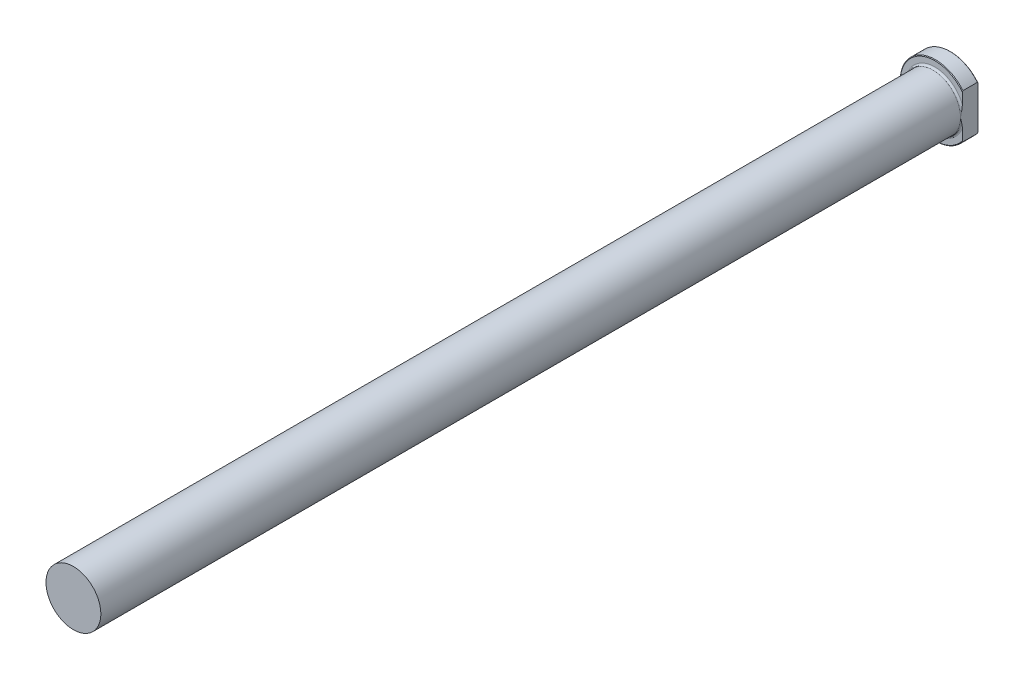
ISO-10303-21;
HEADER;
FILE_DESCRIPTION(('STEP AP214'),'2;1');
FILE_NAME('part.step','',(''),(''),'','','');
FILE_SCHEMA(('AUTOMOTIVE_DESIGN { 1 0 10303 214 1 1 1 1 }'));
ENDSEC;
DATA;
#1=APPLICATION_CONTEXT('core data for automotive mechanical design processes');
#2=APPLICATION_PROTOCOL_DEFINITION('international standard','automotive_design',2000,#1);
#3=PRODUCT_CONTEXT('',#1,'mechanical');
#4=PRODUCT('Part','Part','',(#3));
#5=PRODUCT_RELATED_PRODUCT_CATEGORY('part','',(#4));
#6=PRODUCT_DEFINITION_FORMATION('','',#4);
#7=PRODUCT_DEFINITION_CONTEXT('part definition',#1,'design');
#8=PRODUCT_DEFINITION('design','',#6,#7);
#9=PRODUCT_DEFINITION_SHAPE('','',#8);
#10=(LENGTH_UNIT() NAMED_UNIT(*) SI_UNIT(.MILLI.,.METRE.));
#11=(NAMED_UNIT(*) PLANE_ANGLE_UNIT() SI_UNIT($,.RADIAN.));
#12=(NAMED_UNIT(*) SI_UNIT($,.STERADIAN.) SOLID_ANGLE_UNIT());
#13=UNCERTAINTY_MEASURE_WITH_UNIT(LENGTH_MEASURE(1.E-05),#10,'distance_accuracy_value','');
#14=(GEOMETRIC_REPRESENTATION_CONTEXT(3) GLOBAL_UNCERTAINTY_ASSIGNED_CONTEXT((#13)) GLOBAL_UNIT_ASSIGNED_CONTEXT((#10,
#11,#12)) REPRESENTATION_CONTEXT('',''));
#15=CARTESIAN_POINT('',(0.,0.,0.));
#16=DIRECTION('',(0.,0.,1.));
#17=DIRECTION('',(1.,0.,0.));
#18=AXIS2_PLACEMENT_3D('',#15,#16,#17);
#19=CARTESIAN_POINT('',(0.,0.,0.));
#20=DIRECTION('',(0.,0.,1.));
#21=DIRECTION('',(1.,0.,0.));
#22=AXIS2_PLACEMENT_3D('',#19,#20,#21);
#23=PLANE('',#22);
#24=DIRECTION('',(0.,-1.,0.));
#25=VECTOR('',#24,1.);
#26=CARTESIAN_POINT('',(11.1125,8.98025612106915,0.));
#27=LINE('',#26,#25);
#28=CARTESIAN_POINT('',(11.1125,8.57038307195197,0.));
#29=VERTEX_POINT('',#28);
#30=CARTESIAN_POINT('',(11.1125,-8.57038307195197,0.));
#31=VERTEX_POINT('',#30);
#32=EDGE_CURVE('E196',#29,#31,#27,.T.);
#33=ORIENTED_EDGE('',*,*,#32,.T.);
#34=CARTESIAN_POINT('',(0.,0.,0.));
#35=DIRECTION('',(0.,0.,1.));
#36=DIRECTION('',(1.,0.,0.));
#37=AXIS2_PLACEMENT_3D('',#34,#35,#36);
#38=CIRCLE('',#37,14.0335);
#39=EDGE_CURVE('E11',#31,#29,#38,.F.);
#40=ORIENTED_EDGE('',*,*,#39,.T.);
#41=EDGE_LOOP('',(#33,#40));
#42=FACE_BOUND('',#41,.T.);
#43=ADVANCED_FACE('F36',(#42),#23,.F.);
#44=CARTESIAN_POINT('',(0.,0.,-2.14753999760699));
#45=DIRECTION('',(0.,0.,-1.));
#46=DIRECTION('',(-1.,0.,0.));
#47=AXIS2_PLACEMENT_3D('',#44,#45,#46);
#48=CYLINDRICAL_SURFACE('',#47,14.2875);
#49=DIRECTION('',(0.,0.,-1.));
#50=VECTOR('',#49,1.);
#51=CARTESIAN_POINT('',(11.1125,-8.98025612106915,7.62));
#52=LINE('',#51,#50);
#53=CARTESIAN_POINT('',(11.1125,-8.98025612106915,6.09600000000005));
#54=VERTEX_POINT('',#53);
#55=CARTESIAN_POINT('',(11.1125,-8.98025612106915,0.253999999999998));
#56=VERTEX_POINT('',#55);
#57=EDGE_CURVE('E194',#54,#56,#52,.T.);
#58=ORIENTED_EDGE('',*,*,#57,.F.);
#59=CARTESIAN_POINT('',(0.,0.,6.09600000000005));
#60=DIRECTION('',(0.,0.,-1.));
#61=DIRECTION('',(-1.,0.,0.));
#62=AXIS2_PLACEMENT_3D('',#59,#60,#61);
#63=CIRCLE('',#62,14.2875);
#64=CARTESIAN_POINT('',(11.1125,8.98025612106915,6.09600000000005));
#65=VERTEX_POINT('',#64);
#66=EDGE_CURVE('E113',#54,#65,#63,.T.);
#67=ORIENTED_EDGE('',*,*,#66,.T.);
#68=DIRECTION('',(0.,0.,-1.));
#69=VECTOR('',#68,1.);
#70=CARTESIAN_POINT('',(11.1125,8.98025612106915,7.62));
#71=LINE('',#70,#69);
#72=CARTESIAN_POINT('',(11.1125,8.98025612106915,0.254000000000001));
#73=VERTEX_POINT('',#72);
#74=EDGE_CURVE('E99',#65,#73,#71,.T.);
#75=ORIENTED_EDGE('',*,*,#74,.T.);
#76=CARTESIAN_POINT('',(0.,0.,0.253999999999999));
#77=DIRECTION('',(0.,0.,1.));
#78=DIRECTION('',(1.,0.,0.));
#79=AXIS2_PLACEMENT_3D('',#76,#77,#78);
#80=CIRCLE('',#79,14.2875);
#81=EDGE_CURVE('E110',#73,#56,#80,.T.);
#82=ORIENTED_EDGE('',*,*,#81,.T.);
#83=EDGE_LOOP('',(#58,#67,#75,#82));
#84=FACE_BOUND('',#83,.T.);
#85=ADVANCED_FACE('F172',(#84),#48,.T.);
#86=CARTESIAN_POINT('',(0.,-11.8745,6.35));
#87=DIRECTION('',(0.,0.,-1.));
#88=DIRECTION('',(-1.,0.,0.));
#89=AXIS2_PLACEMENT_3D('',#86,#87,#88);
#90=PLANE('',#89);
#91=DIRECTION('',(0.,-1.,0.));
#92=VECTOR('',#91,1.);
#93=CARTESIAN_POINT('',(11.1125,-11.8745,6.35));
#94=LINE('',#93,#92);
#95=CARTESIAN_POINT('',(11.1125,8.57038307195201,6.35));
#96=VERTEX_POINT('',#95);
#97=CARTESIAN_POINT('',(11.1125,4.18522329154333,6.35));
#98=VERTEX_POINT('',#97);
#99=EDGE_CURVE('E108',#96,#98,#94,.T.);
#100=ORIENTED_EDGE('',*,*,#99,.F.);
#101=CARTESIAN_POINT('',(0.,0.,6.35));
#102=DIRECTION('',(0.,0.,-1.));
#103=DIRECTION('',(-1.,0.,0.));
#104=AXIS2_PLACEMENT_3D('',#101,#102,#103);
#105=CIRCLE('',#104,14.0335000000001);
#106=CARTESIAN_POINT('',(11.1125,-8.57038307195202,6.35));
#107=VERTEX_POINT('',#106);
#108=EDGE_CURVE('E45',#96,#107,#105,.F.);
#109=ORIENTED_EDGE('',*,*,#108,.T.);
#110=CARTESIAN_POINT('',(11.1125,-4.18522329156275,6.35));
#111=VERTEX_POINT('',#110);
#112=EDGE_CURVE('E92',#111,#107,#94,.T.);
#113=ORIENTED_EDGE('',*,*,#112,.F.);
#114=CARTESIAN_POINT('',(0.,0.,6.35));
#115=DIRECTION('',(0.,0.,-1.));
#116=DIRECTION('',(-1.,0.,0.));
#117=AXIS2_PLACEMENT_3D('',#114,#115,#116);
#118=CIRCLE('',#117,11.8745);
#119=EDGE_CURVE('E105',#111,#98,#118,.T.);
#120=ORIENTED_EDGE('',*,*,#119,.T.);
#121=EDGE_LOOP('',(#100,#109,#113,#120));
#122=FACE_BOUND('',#121,.T.);
#123=ADVANCED_FACE('F104',(#122),#90,.F.);
#124=CARTESIAN_POINT('',(0.,0.,7.112));
#125=DIRECTION('',(0.,0.,-1.));
#126=DIRECTION('',(-1.,0.,0.));
#127=AXIS2_PLACEMENT_3D('',#124,#125,#126);
#128=TOROIDAL_SURFACE('',#127,11.8745,0.762000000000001);
#129=CARTESIAN_POINT('',(11.1125,0.,7.112));
#130=CARTESIAN_POINT('',(11.1125,1.67611039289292E-08,7.11200106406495));
#131=CARTESIAN_POINT('',(11.1125,4.27712926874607E-07,7.11200212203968));
#132=CARTESIAN_POINT('',(11.1125,1.5636921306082E-06,7.11200409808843));
#133=CARTESIAN_POINT('',(11.1125,2.31371109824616E-06,7.11200499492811));
#134=CARTESIAN_POINT('',(11.1125,4.10315168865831E-06,7.11200684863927));
#135=CARTESIAN_POINT('',(11.1125,5.17038916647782E-06,7.11200778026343));
#136=CARTESIAN_POINT('',(11.1125,7.38559018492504E-06,7.11200945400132));
#137=CARTESIAN_POINT('',(11.1125,8.53014646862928E-06,7.11201020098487));
#138=CARTESIAN_POINT('',(11.1125,1.29295009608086E-05,7.11201295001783));
#139=CARTESIAN_POINT('',(11.1125,1.62851482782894E-05,7.11201479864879));
#140=CARTESIAN_POINT('',(11.1125,2.29428210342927E-05,7.1120178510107));
#141=CARTESIAN_POINT('',(11.1125,2.62272887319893E-05,7.11201909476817));
#142=CARTESIAN_POINT('',(11.1125,3.99938907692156E-05,7.11202425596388));
#143=CARTESIAN_POINT('',(11.1125,5.05186713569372E-05,7.11202807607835));
#144=CARTESIAN_POINT('',(11.1125,7.04373145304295E-05,7.1120337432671));
#145=CARTESIAN_POINT('',(11.1125,7.97721476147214E-05,7.11203579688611));
#146=CARTESIAN_POINT('',(11.1125,0.000147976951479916,7.11205053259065));
#147=CARTESIAN_POINT('',(11.1125,0.000207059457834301,7.11206183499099));
#148=CARTESIAN_POINT('',(11.1125,0.00043398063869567,7.11211014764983));
#149=CARTESIAN_POINT('',(11.1125,0.000599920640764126,7.11215590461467));
#150=CARTESIAN_POINT('',(11.1125,0.0012263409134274,7.11232554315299));
#151=CARTESIAN_POINT('',(11.1125,0.00168778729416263,7.11244421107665));
#152=CARTESIAN_POINT('',(11.1125,0.0034456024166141,7.11289909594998));
#153=CARTESIAN_POINT('',(11.1125,0.00474111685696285,7.11324022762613));
#154=CARTESIAN_POINT('',(11.1125,0.0108222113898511,7.11483888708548));
#155=CARTESIAN_POINT('',(11.1125,0.0156088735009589,7.116089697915));
#156=CARTESIAN_POINT('',(11.1125,0.0903897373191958,7.13563489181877));
#157=CARTESIAN_POINT('',(11.1125,0.160375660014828,7.1539826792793));
#158=CARTESIAN_POINT('',(11.1125,0.297803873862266,7.18989721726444));
#159=CARTESIAN_POINT('',(11.1125,0.365245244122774,7.2074679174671));
#160=CARTESIAN_POINT('',(11.1125,0.507918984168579,7.24449206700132));
#161=CARTESIAN_POINT('',(11.1125,0.583155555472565,7.26392970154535));
#162=CARTESIAN_POINT('',(11.1125,0.734445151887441,7.3027330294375));
#163=CARTESIAN_POINT('',(11.1125,0.810498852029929,7.32209608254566));
#164=CARTESIAN_POINT('',(11.1125,0.989563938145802,7.36723281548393));
#165=CARTESIAN_POINT('',(11.1125,1.09261341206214,7.39285636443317));
#166=CARTESIAN_POINT('',(11.1125,1.29644189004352,7.44258460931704));
#167=CARTESIAN_POINT('',(11.1125,1.3972156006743,7.46671104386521));
#168=CARTESIAN_POINT('',(11.1125,1.73446900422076,7.54550507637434));
#169=CARTESIAN_POINT('',(11.1125,1.97153771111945,7.59769827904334));
#170=CARTESIAN_POINT('',(11.1125,2.44993274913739,7.69299233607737));
#171=CARTESIAN_POINT('',(11.1125,2.6912781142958,7.73600141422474));
#172=CARTESIAN_POINT('',(11.1125,3.06699799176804,7.79141180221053));
#173=CARTESIAN_POINT('',(11.1125,3.20062030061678,7.80887604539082));
#174=CARTESIAN_POINT('',(11.1125,3.4684556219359,7.8383555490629));
#175=CARTESIAN_POINT('',(11.1125,3.60266850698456,7.85037193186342));
#176=CARTESIAN_POINT('',(11.1125,3.87097309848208,7.86759580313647));
#177=CARTESIAN_POINT('',(11.1125,4.00506287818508,7.8728321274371));
#178=CARTESIAN_POINT('',(11.1125,4.27327734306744,7.87482540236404));
#179=CARTESIAN_POINT('',(11.1125,4.40740193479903,7.87158841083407));
#180=CARTESIAN_POINT('',(11.1125,4.61449108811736,7.85800680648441));
#181=CARTESIAN_POINT('',(11.1125,4.68770973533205,7.85153417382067));
#182=CARTESIAN_POINT('',(11.1125,4.83376141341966,7.83463637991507));
#183=CARTESIAN_POINT('',(11.1125,4.90659410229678,7.82420816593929));
#184=CARTESIAN_POINT('',(11.1125,5.0505087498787,7.79876188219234));
#185=CARTESIAN_POINT('',(11.1125,5.12160117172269,7.78380480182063));
#186=CARTESIAN_POINT('',(11.1125,5.26228423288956,7.7481971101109));
#187=CARTESIAN_POINT('',(11.1125,5.33187647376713,7.72755293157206));
#188=CARTESIAN_POINT('',(11.1125,5.46945846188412,7.67868213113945));
#189=CARTESIAN_POINT('',(11.1125,5.53741805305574,7.65036554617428));
#190=CARTESIAN_POINT('',(11.1125,5.63548783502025,7.60047171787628));
#191=CARTESIAN_POINT('',(11.1125,5.66749530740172,7.58263080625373));
#192=CARTESIAN_POINT('',(11.1125,5.72968299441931,7.54403192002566));
#193=CARTESIAN_POINT('',(11.1125,5.75986551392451,7.52327773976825));
#194=CARTESIAN_POINT('',(11.1125,5.81159971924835,7.48298973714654));
#195=CARTESIAN_POINT('',(11.1125,5.83364406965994,7.46409379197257));
#196=CARTESIAN_POINT('',(11.1125,5.87543896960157,7.423844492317));
#197=CARTESIAN_POINT('',(11.1125,5.89518772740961,7.40248924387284));
#198=CARTESIAN_POINT('',(11.1125,5.93165740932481,7.35685362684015));
#199=CARTESIAN_POINT('',(11.1125,5.94833864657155,7.33254088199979));
#200=CARTESIAN_POINT('',(11.1125,5.97700292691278,7.28128516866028));
#201=CARTESIAN_POINT('',(11.1125,5.98899940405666,7.25435000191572));
#202=CARTESIAN_POINT('',(11.1125,6.00431459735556,7.20647064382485));
#203=CARTESIAN_POINT('',(11.1125,6.00913195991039,7.18600631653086));
#204=CARTESIAN_POINT('',(11.1125,6.01523377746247,7.14455694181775));
#205=CARTESIAN_POINT('',(11.1125,6.01652073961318,7.12357227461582));
#206=CARTESIAN_POINT('',(11.1125,6.01544006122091,7.08168897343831));
#207=CARTESIAN_POINT('',(11.1125,6.01307056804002,7.06079038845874));
#208=CARTESIAN_POINT('',(11.1125,6.00489715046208,7.01967752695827));
#209=CARTESIAN_POINT('',(11.1125,5.99909062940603,6.99946378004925));
#210=CARTESIAN_POINT('',(11.1125,5.9824700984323,6.95468538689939));
#211=CARTESIAN_POINT('',(11.1125,5.97071281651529,6.93047316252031));
#212=CARTESIAN_POINT('',(11.1125,5.94345673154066,6.88426478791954));
#213=CARTESIAN_POINT('',(11.1125,5.92795063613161,6.86227307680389));
#214=CARTESIAN_POINT('',(11.1125,5.88498216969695,6.80914644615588));
#215=CARTESIAN_POINT('',(11.1125,5.85561197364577,6.77956849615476));
#216=CARTESIAN_POINT('',(11.1125,5.79282477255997,6.72511568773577));
#217=CARTESIAN_POINT('',(11.1125,5.7593977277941,6.70025290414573));
#218=CARTESIAN_POINT('',(11.1125,5.69209466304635,6.65587224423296));
#219=CARTESIAN_POINT('',(11.1125,5.65836979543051,6.63612115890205));
#220=CARTESIAN_POINT('',(11.1125,5.58935575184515,6.59954443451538));
#221=CARTESIAN_POINT('',(11.1125,5.55406519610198,6.58272144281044));
#222=CARTESIAN_POINT('',(11.1125,5.44648929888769,6.53592920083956));
#223=CARTESIAN_POINT('',(11.1125,5.37258613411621,6.50968939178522));
#224=CARTESIAN_POINT('',(11.1125,5.21497937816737,6.46235711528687));
#225=CARTESIAN_POINT('',(11.1125,5.13104738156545,6.44206732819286));
#226=CARTESIAN_POINT('',(11.1125,4.96174447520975,6.40841568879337));
#227=CARTESIAN_POINT('',(11.1125,4.87637198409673,6.39506204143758));
#228=CARTESIAN_POINT('',(11.1125,4.70479103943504,6.37390089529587));
#229=CARTESIAN_POINT('',(11.1125,4.61858122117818,6.36610493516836));
#230=CARTESIAN_POINT('',(11.1125,4.44593800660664,6.3551127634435));
#231=CARTESIAN_POINT('',(11.1125,4.35950478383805,6.35191367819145));
#232=CARTESIAN_POINT('',(11.1125,4.18313627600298,6.34931657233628));
#233=CARTESIAN_POINT('',(11.1125,4.09319902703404,6.3500755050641));
#234=CARTESIAN_POINT('',(11.1125,3.91341855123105,6.35512380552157));
#235=CARTESIAN_POINT('',(11.1125,3.82357534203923,6.35941374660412));
#236=CARTESIAN_POINT('',(11.1125,3.55421624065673,6.37680685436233));
#237=CARTESIAN_POINT('',(11.1125,3.37499035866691,6.39443360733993));
#238=CARTESIAN_POINT('',(11.1125,3.01724255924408,6.43872831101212));
#239=CARTESIAN_POINT('',(11.1125,2.83872376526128,6.46542009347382));
#240=CARTESIAN_POINT('',(11.1125,2.48281647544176,6.52563853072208));
#241=CARTESIAN_POINT('',(11.1125,2.30542826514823,6.55916684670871));
#242=CARTESIAN_POINT('',(11.1125,1.77419791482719,6.66743099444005));
#243=CARTESIAN_POINT('',(11.1125,1.42193024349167,6.74975312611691));
#244=CARTESIAN_POINT('',(11.1125,0.719954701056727,6.92356271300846));
#245=CARTESIAN_POINT('',(11.1125,0.370245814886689,7.01504629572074));
#246=CARTESIAN_POINT('',(11.1125,0.0205007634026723,7.10663167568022));
#247=CARTESIAN_POINT('',(11.1125,0.02044813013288,7.10664545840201));
#248=CARTESIAN_POINT('',(11.1125,0.0162997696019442,7.10773169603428));
#249=CARTESIAN_POINT('',(11.1125,0.0122031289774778,7.10879933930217));
#250=CARTESIAN_POINT('',(11.1125,0.00628537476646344,7.11035639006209));
#251=CARTESIAN_POINT('',(11.1125,0.00446277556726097,7.11083797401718));
#252=CARTESIAN_POINT('',(11.1125,0.00204051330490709,7.11146349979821));
#253=CARTESIAN_POINT('',(11.1125,0.00144261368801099,7.11161673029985));
#254=CARTESIAN_POINT('',(11.1125,0.000656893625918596,7.11182849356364));
#255=CARTESIAN_POINT('',(11.1125,0.000467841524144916,7.11188024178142));
#256=CARTESIAN_POINT('',(11.1125,0.000214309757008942,7.11193400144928));
#257=CARTESIAN_POINT('',(11.1125,0.000151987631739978,7.11194599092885));
#258=CARTESIAN_POINT('',(11.1125,8.04801638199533E-05,7.11196214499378));
#259=CARTESIAN_POINT('',(11.1125,7.0965084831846E-05,7.11196434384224));
#260=CARTESIAN_POINT('',(11.1125,5.06772317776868E-05,7.11197043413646));
#261=CARTESIAN_POINT('',(11.1125,3.99730822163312E-05,7.11197455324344));
#262=CARTESIAN_POINT('',(11.1125,2.60206348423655E-05,7.11198010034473));
#263=CARTESIAN_POINT('',(11.1125,2.272273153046E-05,7.11198142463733));
#264=CARTESIAN_POINT('',(11.1125,1.60514754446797E-05,7.11198465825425));
#265=CARTESIAN_POINT('',(11.1125,1.26973590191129E-05,7.11198660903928));
#266=CARTESIAN_POINT('',(11.1125,8.31551979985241E-06,7.1119894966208));
#267=CARTESIAN_POINT('',(11.1125,7.17988653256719E-06,7.11199027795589));
#268=CARTESIAN_POINT('',(11.1125,4.98873174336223E-06,7.11199202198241));
#269=CARTESIAN_POINT('',(11.1125,3.93683648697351E-06,7.11199298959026));
#270=CARTESIAN_POINT('',(11.1125,2.18345050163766E-06,7.11199490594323));
#271=CARTESIAN_POINT('',(11.1125,1.45279924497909E-06,7.11199582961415));
#272=CARTESIAN_POINT('',(11.1125,3.65698335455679E-07,7.11199785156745));
#273=CARTESIAN_POINT('',(11.1125,-1.68724016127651E-08,7.11199892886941));
#274=CARTESIAN_POINT('',(11.1125,0.,7.112));
#275=B_SPLINE_CURVE_WITH_KNOTS('',3,(#129,#130,#131,#132,#133,#134,#135,#136,#137,#138,#139,
#140,#141,#142,#143,#144,#145,#146,#147,#148,#149,#150,#151,#152,#153,#154,#155,#156,#157,#158,
#159,#160,#161,#162,#163,#164,#165,#166,#167,#168,#169,#170,#171,#172,#173,#174,#175,#176,#177,
#178,#179,#180,#181,#182,#183,#184,#185,#186,#187,#188,#189,#190,#191,#192,#193,#194,#195,#196,
#197,#198,#199,#200,#201,#202,#203,#204,#205,#206,#207,#208,#209,#210,#211,#212,#213,#214,#215,
#216,#217,#218,#219,#220,#221,#222,#223,#224,#225,#226,#227,#228,#229,#230,#231,#232,#233,#234,
#235,#236,#237,#238,#239,#240,#241,#242,#243,#244,#245,#246,#247,#248,#249,#250,#251,#252,#253,
#254,#255,#256,#257,#258,#259,#260,#261,#262,#263,#264,#265,#266,#267,#268,#269,#270,#271,#272,
#273,#274),.UNSPECIFIED.,.T.,.F.,(4,2,2,2,2,2,2,2,2,2,2,2,2,2,2,2,2,2,2,2,2,2,2,2,2,2,2,2,2,2,2,
2,2,2,2,2,2,2,2,2,2,2,2,2,2,2,2,2,2,2,2,2,2,2,2,2,2,2,2,2,2,2,2,2,2,2,2,2,2,2,2,2,4),(0.,
3.21749080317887E-06,6.72527292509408E-06,1.09505995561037E-05,1.5048438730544E-05,
2.65003533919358E-05,3.70273618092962E-05,7.05609839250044E-05,9.92021986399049E-05,
0.000279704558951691,0.000795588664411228,0.00222546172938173,0.0062439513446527,
0.0210868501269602,0.238132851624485,0.447212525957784,0.680332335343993,0.915771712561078,
1.23432999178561,1.54519220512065,2.27332049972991,3.00841570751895,3.41260707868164,
3.81671514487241,4.21909881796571,4.62119489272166,4.84162349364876,5.06222255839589,
5.27997385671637,5.49747985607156,5.71765571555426,5.82747004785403,5.9371426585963,
6.02409526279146,6.11111528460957,6.19919218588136,6.28701462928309,6.34981252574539,
6.41256581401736,6.47535090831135,6.53818349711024,6.61848147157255,6.69893691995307,
6.82328358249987,6.94794450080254,7.06501811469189,7.18219703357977,7.41685552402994,
7.67555303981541,7.93455588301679,8.19409490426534,8.4534716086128,8.72321009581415,
8.99299239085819,9.53291461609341,10.0742674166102,10.6157519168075,11.7006579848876,
12.7851073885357,12.785270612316,12.7979720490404,12.8036266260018,12.8054789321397,
12.8060663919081,12.8062568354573,12.8062860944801,12.8063204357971,12.8063310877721,
12.8063426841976,12.8063468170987,12.8063510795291,12.8063546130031,12.8063578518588),.UNSPECIFIED.);
#276=CARTESIAN_POINT('',(11.1125,0.,7.112));
#277=VERTEX_POINT('',#276);
#278=EDGE_CURVE('E95',#98,#277,#275,.T.);
#279=ORIENTED_EDGE('',*,*,#278,.F.);
#280=ORIENTED_EDGE('',*,*,#119,.F.);
#281=CARTESIAN_POINT('',(11.1125,0.,7.112));
#282=CARTESIAN_POINT('',(11.1125,-1.67611039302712E-08,7.11199893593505));
#283=CARTESIAN_POINT('',(11.1125,-4.27712926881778E-07,7.11199787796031));
#284=CARTESIAN_POINT('',(11.1125,-1.56369213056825E-06,7.11199590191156));
#285=CARTESIAN_POINT('',(11.1125,-2.31371109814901E-06,7.11199500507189));
#286=CARTESIAN_POINT('',(11.1125,-4.10315168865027E-06,7.11199315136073));
#287=CARTESIAN_POINT('',(11.1125,-5.17038916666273E-06,7.11199221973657));
#288=CARTESIAN_POINT('',(11.1125,-7.38559018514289E-06,7.11199054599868));
#289=CARTESIAN_POINT('',(11.1125,-8.53014646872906E-06,7.11198979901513));
#290=CARTESIAN_POINT('',(11.1125,-1.29295009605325E-05,7.11198704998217));
#291=CARTESIAN_POINT('',(11.1125,-1.62851482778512E-05,7.1119852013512));
#292=CARTESIAN_POINT('',(11.1125,-2.29428210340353E-05,7.1119821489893));
#293=CARTESIAN_POINT('',(11.1125,-2.6227288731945E-05,7.11198090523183));
#294=CARTESIAN_POINT('',(11.1125,-3.99938907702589E-05,7.11197574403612));
#295=CARTESIAN_POINT('',(11.1125,-5.05186713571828E-05,7.11197192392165));
#296=CARTESIAN_POINT('',(11.1125,-7.04373145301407E-05,7.1119662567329));
#297=CARTESIAN_POINT('',(11.1125,-7.97721476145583E-05,7.11196420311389));
#298=CARTESIAN_POINT('',(11.1125,-0.000147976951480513,7.11194946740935));
#299=CARTESIAN_POINT('',(11.1125,-0.000207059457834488,7.11193816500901));
#300=CARTESIAN_POINT('',(11.1125,-0.000433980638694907,7.11188985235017));
#301=CARTESIAN_POINT('',(11.1125,-0.000599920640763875,7.11184409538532));
#302=CARTESIAN_POINT('',(11.1125,-0.00122634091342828,7.11167445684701));
#303=CARTESIAN_POINT('',(11.1125,-0.00168778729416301,7.11155578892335));
#304=CARTESIAN_POINT('',(11.1125,-0.00344560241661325,7.11110090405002));
#305=CARTESIAN_POINT('',(11.1125,-0.0047411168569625,7.11075977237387));
#306=CARTESIAN_POINT('',(11.1125,-0.0108222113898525,7.10916111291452));
#307=CARTESIAN_POINT('',(11.1125,-0.0156088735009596,7.107910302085));
#308=CARTESIAN_POINT('',(11.1125,-0.0903897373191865,7.08836510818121));
#309=CARTESIAN_POINT('',(11.1125,-0.160375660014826,7.07001732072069));
#310=CARTESIAN_POINT('',(11.1125,-0.297803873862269,7.03410278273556));
#311=CARTESIAN_POINT('',(11.1125,-0.365245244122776,7.0165320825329));
#312=CARTESIAN_POINT('',(11.1125,-0.50791898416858,6.97950793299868));
#313=CARTESIAN_POINT('',(11.1125,-0.583155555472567,6.96007029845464));
#314=CARTESIAN_POINT('',(11.1125,-0.734445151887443,6.9212669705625));
#315=CARTESIAN_POINT('',(11.1125,-0.81049885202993,6.90190391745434));
#316=CARTESIAN_POINT('',(11.1125,-0.989563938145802,6.85676718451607));
#317=CARTESIAN_POINT('',(11.1125,-1.09261341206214,6.83114363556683));
#318=CARTESIAN_POINT('',(11.1125,-1.29644189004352,6.78141539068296));
#319=CARTESIAN_POINT('',(11.1125,-1.3972156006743,6.75728895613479));
#320=CARTESIAN_POINT('',(11.1125,-1.73446900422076,6.67849492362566));
#321=CARTESIAN_POINT('',(11.1125,-1.97153771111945,6.62630172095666));
#322=CARTESIAN_POINT('',(11.1125,-2.44993274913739,6.53100766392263));
#323=CARTESIAN_POINT('',(11.1125,-2.6912781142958,6.48799858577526));
#324=CARTESIAN_POINT('',(11.1125,-3.06699799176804,6.43258819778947));
#325=CARTESIAN_POINT('',(11.1125,-3.20062030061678,6.41512395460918));
#326=CARTESIAN_POINT('',(11.1125,-3.4684556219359,6.3856444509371));
#327=CARTESIAN_POINT('',(11.1125,-3.60266850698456,6.37362806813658));
#328=CARTESIAN_POINT('',(11.1125,-3.87097309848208,6.35640419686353));
#329=CARTESIAN_POINT('',(11.1125,-4.00506287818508,6.3511678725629));
#330=CARTESIAN_POINT('',(11.1125,-4.27327734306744,6.34917459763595));
#331=CARTESIAN_POINT('',(11.1125,-4.40740193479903,6.35241158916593));
#332=CARTESIAN_POINT('',(11.1125,-4.61449108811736,6.36599319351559));
#333=CARTESIAN_POINT('',(11.1125,-4.68770973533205,6.37246582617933));
#334=CARTESIAN_POINT('',(11.1125,-4.83376141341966,6.38936362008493));
#335=CARTESIAN_POINT('',(11.1125,-4.90659410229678,6.39979183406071));
#336=CARTESIAN_POINT('',(11.1125,-5.0505087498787,6.42523811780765));
#337=CARTESIAN_POINT('',(11.1125,-5.12160117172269,6.44019519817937));
#338=CARTESIAN_POINT('',(11.1125,-5.26228423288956,6.47580288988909));
#339=CARTESIAN_POINT('',(11.1125,-5.33187647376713,6.49644706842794));
#340=CARTESIAN_POINT('',(11.1125,-5.46945846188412,6.54531786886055));
#341=CARTESIAN_POINT('',(11.1125,-5.53741805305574,6.57363445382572));
#342=CARTESIAN_POINT('',(11.1125,-5.63548783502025,6.62352828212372));
#343=CARTESIAN_POINT('',(11.1125,-5.66749530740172,6.64136919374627));
#344=CARTESIAN_POINT('',(11.1125,-5.72968299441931,6.67996807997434));
#345=CARTESIAN_POINT('',(11.1125,-5.75986551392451,6.70072226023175));
#346=CARTESIAN_POINT('',(11.1125,-5.81159971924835,6.74101026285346));
#347=CARTESIAN_POINT('',(11.1125,-5.83364406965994,6.75990620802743));
#348=CARTESIAN_POINT('',(11.1125,-5.87543896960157,6.800155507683));
#349=CARTESIAN_POINT('',(11.1125,-5.89518772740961,6.82151075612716));
#350=CARTESIAN_POINT('',(11.1125,-5.93165740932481,6.86714637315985));
#351=CARTESIAN_POINT('',(11.1125,-5.94833864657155,6.8914591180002));
#352=CARTESIAN_POINT('',(11.1125,-5.97700292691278,6.94271483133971));
#353=CARTESIAN_POINT('',(11.1125,-5.98899940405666,6.96964999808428));
#354=CARTESIAN_POINT('',(11.1125,-6.00431459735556,7.01752935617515));
#355=CARTESIAN_POINT('',(11.1125,-6.00913195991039,7.03799368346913));
#356=CARTESIAN_POINT('',(11.1125,-6.01523377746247,7.07944305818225));
#357=CARTESIAN_POINT('',(11.1125,-6.01652073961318,7.10042772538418));
#358=CARTESIAN_POINT('',(11.1125,-6.01544006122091,7.14231102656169));
#359=CARTESIAN_POINT('',(11.1125,-6.01307056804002,7.16320961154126));
#360=CARTESIAN_POINT('',(11.1125,-6.00489715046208,7.20432247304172));
#361=CARTESIAN_POINT('',(11.1125,-5.99909062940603,7.22453621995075));
#362=CARTESIAN_POINT('',(11.1125,-5.9824700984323,7.26931461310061));
#363=CARTESIAN_POINT('',(11.1125,-5.97071281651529,7.29352683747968));
#364=CARTESIAN_POINT('',(11.1125,-5.94345673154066,7.33973521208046));
#365=CARTESIAN_POINT('',(11.1125,-5.92795063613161,7.36172692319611));
#366=CARTESIAN_POINT('',(11.1125,-5.88498216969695,7.41485355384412));
#367=CARTESIAN_POINT('',(11.1125,-5.85561197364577,7.44443150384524));
#368=CARTESIAN_POINT('',(11.1125,-5.79282477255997,7.49888431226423));
#369=CARTESIAN_POINT('',(11.1125,-5.7593977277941,7.52374709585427));
#370=CARTESIAN_POINT('',(11.1125,-5.69209466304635,7.56812775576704));
#371=CARTESIAN_POINT('',(11.1125,-5.65836979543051,7.58787884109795));
#372=CARTESIAN_POINT('',(11.1125,-5.58935575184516,7.62445556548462));
#373=CARTESIAN_POINT('',(11.1125,-5.55406519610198,7.64127855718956));
#374=CARTESIAN_POINT('',(11.1125,-5.44648929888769,7.68807079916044));
#375=CARTESIAN_POINT('',(11.1125,-5.37258613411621,7.71431060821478));
#376=CARTESIAN_POINT('',(11.1125,-5.21497937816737,7.76164288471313));
#377=CARTESIAN_POINT('',(11.1125,-5.13104738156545,7.78193267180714));
#378=CARTESIAN_POINT('',(11.1125,-4.96174447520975,7.81558431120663));
#379=CARTESIAN_POINT('',(11.1125,-4.87637198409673,7.82893795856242));
#380=CARTESIAN_POINT('',(11.1125,-4.70479103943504,7.85009910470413));
#381=CARTESIAN_POINT('',(11.1125,-4.61858122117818,7.85789506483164));
#382=CARTESIAN_POINT('',(11.1125,-4.44593800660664,7.8688872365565));
#383=CARTESIAN_POINT('',(11.1125,-4.35950478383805,7.87208632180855));
#384=CARTESIAN_POINT('',(11.1125,-4.18313627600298,7.87468342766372));
#385=CARTESIAN_POINT('',(11.1125,-4.09319902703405,7.8739244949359));
#386=CARTESIAN_POINT('',(11.1125,-3.91341855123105,7.86887619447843));
#387=CARTESIAN_POINT('',(11.1125,-3.82357534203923,7.86458625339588));
#388=CARTESIAN_POINT('',(11.1125,-3.55421624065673,7.84719314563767));
#389=CARTESIAN_POINT('',(11.1125,-3.37499035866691,7.82956639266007));
#390=CARTESIAN_POINT('',(11.1125,-3.01724255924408,7.78527168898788));
#391=CARTESIAN_POINT('',(11.1125,-2.83872376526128,7.75857990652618));
#392=CARTESIAN_POINT('',(11.1125,-2.48281647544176,7.69836146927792));
#393=CARTESIAN_POINT('',(11.1125,-2.30542826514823,7.66483315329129));
#394=CARTESIAN_POINT('',(11.1125,-1.77419791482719,7.55656900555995));
#395=CARTESIAN_POINT('',(11.1125,-1.42193024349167,7.47424687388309));
#396=CARTESIAN_POINT('',(11.1125,-0.719954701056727,7.30043728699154));
#397=CARTESIAN_POINT('',(11.1125,-0.370245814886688,7.20895370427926));
#398=CARTESIAN_POINT('',(11.1125,-0.0205007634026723,7.11736832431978));
#399=CARTESIAN_POINT('',(11.1125,-0.02044813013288,7.11735454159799));
#400=CARTESIAN_POINT('',(11.1125,-0.0162997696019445,7.11626830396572));
#401=CARTESIAN_POINT('',(11.1125,-0.0122031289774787,7.11520066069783));
#402=CARTESIAN_POINT('',(11.1125,-0.0062853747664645,7.11364360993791));
#403=CARTESIAN_POINT('',(11.1125,-0.00446277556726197,7.11316202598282));
#404=CARTESIAN_POINT('',(11.1125,-0.00204051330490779,7.11253650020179));
#405=CARTESIAN_POINT('',(11.1125,-0.00144261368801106,7.11238326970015));
#406=CARTESIAN_POINT('',(11.1125,-0.000656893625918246,7.11217150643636));
#407=CARTESIAN_POINT('',(11.1125,-0.000467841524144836,7.11211975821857));
#408=CARTESIAN_POINT('',(11.1125,-0.000214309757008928,7.11206599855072));
#409=CARTESIAN_POINT('',(11.1125,-0.000151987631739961,7.11205400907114));
#410=CARTESIAN_POINT('',(11.1125,-8.04801638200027E-05,7.11203785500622));
#411=CARTESIAN_POINT('',(11.1125,-7.09650848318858E-05,7.11203565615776));
#412=CARTESIAN_POINT('',(11.1125,-5.06772317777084E-05,7.11202956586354));
#413=CARTESIAN_POINT('',(11.1125,-3.99730822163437E-05,7.11202544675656));
#414=CARTESIAN_POINT('',(11.1125,-2.60206348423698E-05,7.11201989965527));
#415=CARTESIAN_POINT('',(11.1125,-2.2722731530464E-05,7.11201857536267));
#416=CARTESIAN_POINT('',(11.1125,-1.60514754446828E-05,7.11201534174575));
#417=CARTESIAN_POINT('',(11.1125,-1.26973590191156E-05,7.11201339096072));
#418=CARTESIAN_POINT('',(11.1125,-8.31551979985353E-06,7.1120105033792));
#419=CARTESIAN_POINT('',(11.1125,-7.17988653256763E-06,7.11200972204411));
#420=CARTESIAN_POINT('',(11.1125,-4.98873174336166E-06,7.11200797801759));
#421=CARTESIAN_POINT('',(11.1125,-3.93683648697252E-06,7.11200701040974));
#422=CARTESIAN_POINT('',(11.1125,-2.18345050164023E-06,7.11200509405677));
#423=CARTESIAN_POINT('',(11.1125,-1.4527992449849E-06,7.11200417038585));
#424=CARTESIAN_POINT('',(11.1125,-3.65698335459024E-07,7.11200214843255));
#425=CARTESIAN_POINT('',(11.1125,1.6872401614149E-08,7.11200107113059));
#426=CARTESIAN_POINT('',(11.1125,0.,7.112));
#427=B_SPLINE_CURVE_WITH_KNOTS('',3,(#281,#282,#283,#284,#285,#286,#287,#288,#289,#290,#291,
#292,#293,#294,#295,#296,#297,#298,#299,#300,#301,#302,#303,#304,#305,#306,#307,#308,#309,#310,
#311,#312,#313,#314,#315,#316,#317,#318,#319,#320,#321,#322,#323,#324,#325,#326,#327,#328,#329,
#330,#331,#332,#333,#334,#335,#336,#337,#338,#339,#340,#341,#342,#343,#344,#345,#346,#347,#348,
#349,#350,#351,#352,#353,#354,#355,#356,#357,#358,#359,#360,#361,#362,#363,#364,#365,#366,#367,
#368,#369,#370,#371,#372,#373,#374,#375,#376,#377,#378,#379,#380,#381,#382,#383,#384,#385,#386,
#387,#388,#389,#390,#391,#392,#393,#394,#395,#396,#397,#398,#399,#400,#401,#402,#403,#404,#405,
#406,#407,#408,#409,#410,#411,#412,#413,#414,#415,#416,#417,#418,#419,#420,#421,#422,#423,#424,
#425,#426),.UNSPECIFIED.,.T.,.F.,(4,2,2,2,2,2,2,2,2,2,2,2,2,2,2,2,2,2,2,2,2,2,2,2,2,2,2,2,2,2,2,
2,2,2,2,2,2,2,2,2,2,2,2,2,2,2,2,2,2,2,2,2,2,2,2,2,2,2,2,2,2,2,2,2,2,2,2,2,2,2,2,2,4),(0.,
3.21749080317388E-06,6.72527292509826E-06,1.09505995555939E-05,1.50484387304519E-05,
2.650035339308E-05,3.70273618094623E-05,7.05609839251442E-05,9.92021986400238E-05,
0.000279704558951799,0.000795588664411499,0.00222546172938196,0.00624395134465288,
0.0210868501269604,0.238132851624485,0.447212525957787,0.680332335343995,0.915771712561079,
1.23432999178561,1.54519220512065,2.27332049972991,3.00841570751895,3.41260707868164,
3.81671514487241,4.21909881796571,4.62119489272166,4.84162349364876,5.06222255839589,
5.27997385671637,5.49747985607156,5.71765571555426,5.82747004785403,5.9371426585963,
6.02409526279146,6.11111528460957,6.19919218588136,6.28701462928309,6.34981252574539,
6.41256581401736,6.47535090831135,6.53818349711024,6.61848147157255,6.69893691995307,
6.82328358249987,6.94794450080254,7.06501811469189,7.18219703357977,7.41685552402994,
7.67555303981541,7.93455588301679,8.19409490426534,8.45347160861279,8.72321009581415,
8.99299239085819,9.53291461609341,10.0742674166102,10.6157519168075,11.7006579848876,
12.7851073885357,12.785270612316,12.7979720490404,12.8036266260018,12.8054789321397,
12.8060663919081,12.8062568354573,12.8062860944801,12.8063204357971,12.8063310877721,
12.8063426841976,12.8063468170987,12.8063510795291,12.8063546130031,12.8063578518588),.UNSPECIFIED.);
#428=EDGE_CURVE('E88',#277,#111,#427,.T.);
#429=ORIENTED_EDGE('',*,*,#428,.F.);
#430=CARTESIAN_POINT('',(0.,0.,7.112));
#431=DIRECTION('',(0.,0.,-1.));
#432=DIRECTION('',(-1.,0.,0.));
#433=AXIS2_PLACEMENT_3D('',#430,#431,#432);
#434=CIRCLE('',#433,11.1125);
#435=EDGE_CURVE('E111',#277,#277,#434,.T.);
#436=ORIENTED_EDGE('',*,*,#435,.T.);
#437=EDGE_LOOP('',(#279,#280,#429,#436));
#438=FACE_BOUND('',#437,.T.);
#439=ADVANCED_FACE('F109',(#438),#128,.F.);
#440=CARTESIAN_POINT('',(0.,0.,-2.14753999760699));
#441=DIRECTION('',(0.,0.,-1.));
#442=DIRECTION('',(-1.,0.,0.));
#443=AXIS2_PLACEMENT_3D('',#440,#441,#442);
#444=CYLINDRICAL_SURFACE('',#443,11.1125);
#445=ORIENTED_EDGE('',*,*,#435,.F.);
#446=EDGE_LOOP('',(#445));
#447=FACE_BOUND('',#446,.T.);
#448=CARTESIAN_POINT('',(0.,0.,355.6));
#449=DIRECTION('',(0.,0.,-1.));
#450=DIRECTION('',(-1.,0.,0.));
#451=AXIS2_PLACEMENT_3D('',#448,#449,#450);
#452=CIRCLE('',#451,11.1125);
#453=CARTESIAN_POINT('',(-11.1125,0.,355.6));
#454=VERTEX_POINT('',#453);
#455=EDGE_CURVE('E115',#454,#454,#452,.T.);
#456=ORIENTED_EDGE('',*,*,#455,.T.);
#457=EDGE_LOOP('',(#456));
#458=FACE_BOUND('',#457,.T.);
#459=ADVANCED_FACE('F180',(#447,#458),#444,.T.);
#460=CARTESIAN_POINT('',(0.,0.,355.6));
#461=DIRECTION('',(0.,0.,-1.));
#462=DIRECTION('',(-1.,0.,0.));
#463=AXIS2_PLACEMENT_3D('',#460,#461,#462);
#464=PLANE('',#463);
#465=ORIENTED_EDGE('',*,*,#455,.F.);
#466=EDGE_LOOP('',(#465));
#467=FACE_BOUND('',#466,.T.);
#468=ADVANCED_FACE('F136',(#467),#464,.F.);
#469=CARTESIAN_POINT('',(11.1125,8.98025612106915,7.62));
#470=DIRECTION('',(1.,0.,0.));
#471=DIRECTION('',(0.,0.,-1.));
#472=AXIS2_PLACEMENT_3D('',#469,#470,#471);
#473=PLANE('',#472);
#474=ORIENTED_EDGE('',*,*,#74,.F.);
#475=CARTESIAN_POINT('',(11.1125,8.98025612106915,6.09600000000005));
#476=CARTESIAN_POINT('',(11.1125,8.91221662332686,6.1387733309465));
#477=CARTESIAN_POINT('',(11.1125,8.84404079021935,6.18132666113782));
#478=CARTESIAN_POINT('',(11.1125,8.70741644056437,6.26599332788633));
#479=CARTESIAN_POINT('',(11.1125,8.63896792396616,6.30810666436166));
#480=CARTESIAN_POINT('',(11.1125,8.57038307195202,6.35));
#481=B_SPLINE_CURVE_WITH_KNOTS('',3,(#475,#476,#477,#478,#479,#480),.UNSPECIFIED.,.F.,.F.,(4,2,
4),(0.,0.24109867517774,0.482197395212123),.UNSPECIFIED.);
#482=EDGE_CURVE('E160',#65,#96,#481,.T.);
#483=ORIENTED_EDGE('',*,*,#482,.T.);
#484=ORIENTED_EDGE('',*,*,#99,.T.);
#485=ORIENTED_EDGE('',*,*,#278,.T.);
#486=ORIENTED_EDGE('',*,*,#428,.T.);
#487=ORIENTED_EDGE('',*,*,#112,.T.);
#488=CARTESIAN_POINT('',(11.1125,-8.57038307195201,6.35));
#489=CARTESIAN_POINT('',(11.1125,-8.63896792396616,6.30810666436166));
#490=CARTESIAN_POINT('',(11.1125,-8.70741644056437,6.26599332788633));
#491=CARTESIAN_POINT('',(11.1125,-8.84404079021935,6.18132666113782));
#492=CARTESIAN_POINT('',(11.1125,-8.91221662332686,6.1387733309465));
#493=CARTESIAN_POINT('',(11.1125,-8.98025612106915,6.09600000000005));
#494=B_SPLINE_CURVE_WITH_KNOTS('',3,(#488,#489,#490,#491,#492,#493),.UNSPECIFIED.,.F.,.F.,(4,2,
4),(0.,0.24109872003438,0.482197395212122),.UNSPECIFIED.);
#495=EDGE_CURVE('E155',#107,#54,#494,.T.);
#496=ORIENTED_EDGE('',*,*,#495,.T.);
#497=ORIENTED_EDGE('',*,*,#57,.T.);
#498=CARTESIAN_POINT('',(11.1125,-8.98025612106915,0.253999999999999));
#499=CARTESIAN_POINT('',(11.1125,-8.91221662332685,0.211226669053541));
#500=CARTESIAN_POINT('',(11.1125,-8.84404079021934,0.168673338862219));
#501=CARTESIAN_POINT('',(11.1125,-8.70741644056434,0.0840066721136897));
#502=CARTESIAN_POINT('',(11.1125,-8.63896792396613,0.0418933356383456));
#503=CARTESIAN_POINT('',(11.1125,-8.57038307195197,0.));
#504=B_SPLINE_CURVE_WITH_KNOTS('',3,(#498,#499,#500,#501,#502,#503),.UNSPECIFIED.,.F.,.F.,(4,2,
4),(0.,0.241098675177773,0.482197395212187),.UNSPECIFIED.);
#505=EDGE_CURVE('E52',#56,#31,#504,.T.);
#506=ORIENTED_EDGE('',*,*,#505,.T.);
#507=ORIENTED_EDGE('',*,*,#32,.F.);
#508=CARTESIAN_POINT('',(11.1125,8.57038307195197,0.));
#509=CARTESIAN_POINT('',(11.1125,8.63896792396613,0.0418933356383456));
#510=CARTESIAN_POINT('',(11.1125,8.70741644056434,0.0840066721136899));
#511=CARTESIAN_POINT('',(11.1125,8.84404079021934,0.168673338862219));
#512=CARTESIAN_POINT('',(11.1125,8.91221662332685,0.211226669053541));
#513=CARTESIAN_POINT('',(11.1125,8.98025612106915,0.253999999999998));
#514=B_SPLINE_CURVE_WITH_KNOTS('',3,(#508,#509,#510,#511,#512,#513),.UNSPECIFIED.,.F.,.F.,(4,2,
4),(0.,0.241098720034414,0.482197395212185),.UNSPECIFIED.);
#515=EDGE_CURVE('E60',#29,#73,#514,.T.);
#516=ORIENTED_EDGE('',*,*,#515,.T.);
#517=EDGE_LOOP('',(#474,#483,#484,#485,#486,#487,#496,#497,#506,#507,#516));
#518=FACE_BOUND('',#517,.T.);
#519=ADVANCED_FACE('F91',(#518),#473,.T.);
#520=CARTESIAN_POINT('',(0.,0.,6.09600000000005));
#521=DIRECTION('',(0.,0.,-1.));
#522=DIRECTION('',(-1.,0.,0.));
#523=AXIS2_PLACEMENT_3D('',#520,#521,#522);
#524=CONICAL_SURFACE('',#523,14.2875,0.785398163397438);
#525=ORIENTED_EDGE('',*,*,#495,.F.);
#526=ORIENTED_EDGE('',*,*,#108,.F.);
#527=ORIENTED_EDGE('',*,*,#482,.F.);
#528=ORIENTED_EDGE('',*,*,#66,.F.);
#529=EDGE_LOOP('',(#525,#526,#527,#528));
#530=FACE_BOUND('',#529,.T.);
#531=ADVANCED_FACE('F135',(#530),#524,.T.);
#532=CARTESIAN_POINT('',(0.,0.,0.));
#533=DIRECTION('',(0.,0.,1.));
#534=DIRECTION('',(1.,0.,0.));
#535=AXIS2_PLACEMENT_3D('',#532,#533,#534);
#536=CONICAL_SURFACE('',#535,14.0335,0.785398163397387);
#537=ORIENTED_EDGE('',*,*,#505,.F.);
#538=ORIENTED_EDGE('',*,*,#81,.F.);
#539=ORIENTED_EDGE('',*,*,#515,.F.);
#540=ORIENTED_EDGE('',*,*,#39,.F.);
#541=EDGE_LOOP('',(#537,#538,#539,#540));
#542=FACE_BOUND('',#541,.T.);
#543=ADVANCED_FACE('F38',(#542),#536,.T.);
#544=CLOSED_SHELL('',(#43,#85,#123,#439,#459,#468,#519,#531,#543));
#545=MANIFOLD_SOLID_BREP('B2',#544);
#546=ADVANCED_BREP_SHAPE_REPRESENTATION('',(#18,#545),#14);
#547=SHAPE_DEFINITION_REPRESENTATION(#9,#546);
ENDSEC;
END-ISO-10303-21;
